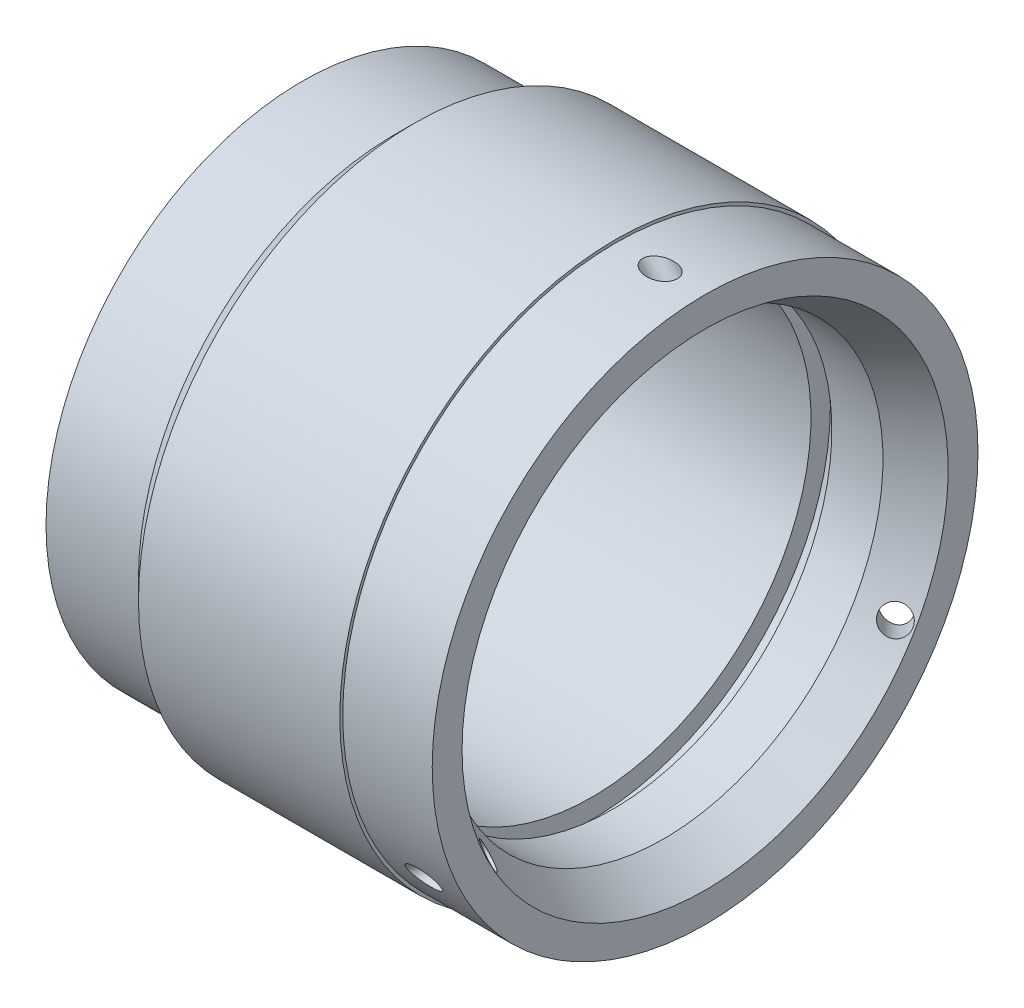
ISO-10303-21;
HEADER;
FILE_DESCRIPTION(('STEP AP214'),'2;1');
FILE_NAME('part.step','',(''),(''),'','','');
FILE_SCHEMA(('AUTOMOTIVE_DESIGN { 1 0 10303 214 1 1 1 1 }'));
ENDSEC;
DATA;
#1=APPLICATION_CONTEXT('core data for automotive mechanical design processes');
#2=APPLICATION_PROTOCOL_DEFINITION('international standard','automotive_design',2000,#1);
#3=PRODUCT_CONTEXT('',#1,'mechanical');
#4=PRODUCT('Part','Part','',(#3));
#5=PRODUCT_RELATED_PRODUCT_CATEGORY('part','',(#4));
#6=PRODUCT_DEFINITION_FORMATION('','',#4);
#7=PRODUCT_DEFINITION_CONTEXT('part definition',#1,'design');
#8=PRODUCT_DEFINITION('design','',#6,#7);
#9=PRODUCT_DEFINITION_SHAPE('','',#8);
#10=(LENGTH_UNIT() NAMED_UNIT(*) SI_UNIT(.MILLI.,.METRE.));
#11=(NAMED_UNIT(*) PLANE_ANGLE_UNIT() SI_UNIT($,.RADIAN.));
#12=(NAMED_UNIT(*) SI_UNIT($,.STERADIAN.) SOLID_ANGLE_UNIT());
#13=UNCERTAINTY_MEASURE_WITH_UNIT(LENGTH_MEASURE(1.E-05),#10,'distance_accuracy_value','');
#14=(GEOMETRIC_REPRESENTATION_CONTEXT(3) GLOBAL_UNCERTAINTY_ASSIGNED_CONTEXT((#13)) GLOBAL_UNIT_ASSIGNED_CONTEXT((#10,
#11,#12)) REPRESENTATION_CONTEXT('',''));
#15=CARTESIAN_POINT('',(0.,0.,0.));
#16=DIRECTION('',(0.,0.,1.));
#17=DIRECTION('',(1.,0.,0.));
#18=AXIS2_PLACEMENT_3D('',#15,#16,#17);
#19=CARTESIAN_POINT('',(0.,0.,0.));
#20=DIRECTION('',(-1.,0.,0.));
#21=DIRECTION('',(0.,0.,1.));
#22=AXIS2_PLACEMENT_3D('',#19,#20,#21);
#23=CYLINDRICAL_SURFACE('',#22,8.6);
#24=CARTESIAN_POINT('',(0.,0.,0.));
#25=DIRECTION('',(-1.,0.,0.));
#26=DIRECTION('',(0.,0.,1.));
#27=AXIS2_PLACEMENT_3D('',#24,#25,#26);
#28=CIRCLE('',#27,8.6);
#29=CARTESIAN_POINT('',(0.,0.,8.6));
#30=VERTEX_POINT('',#29);
#31=EDGE_CURVE('E86',#30,#30,#28,.T.);
#32=ORIENTED_EDGE('',*,*,#31,.F.);
#33=EDGE_LOOP('',(#32));
#34=FACE_BOUND('',#33,.T.);
#35=CARTESIAN_POINT('',(3.1,0.,0.));
#36=DIRECTION('',(-1.,0.,0.));
#37=DIRECTION('',(0.,0.,1.));
#38=AXIS2_PLACEMENT_3D('',#35,#36,#37);
#39=CIRCLE('',#38,8.6);
#40=CARTESIAN_POINT('',(3.1,0.,8.6));
#41=VERTEX_POINT('',#40);
#42=EDGE_CURVE('E10',#41,#41,#39,.T.);
#43=ORIENTED_EDGE('',*,*,#42,.T.);
#44=EDGE_LOOP('',(#43));
#45=FACE_BOUND('',#44,.T.);
#46=ADVANCED_FACE('F34',(#34,#45),#23,.T.);
#47=CARTESIAN_POINT('',(3.75,0.,0.));
#48=DIRECTION('',(1.,0.,0.));
#49=DIRECTION('',(0.,0.,-1.));
#50=AXIS2_PLACEMENT_3D('',#47,#48,#49);
#51=CONICAL_SURFACE('',#50,9.25,0.785398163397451);
#52=ORIENTED_EDGE('',*,*,#42,.F.);
#53=EDGE_LOOP('',(#52));
#54=FACE_BOUND('',#53,.T.);
#55=CARTESIAN_POINT('',(3.75,0.,0.));
#56=DIRECTION('',(-1.,0.,0.));
#57=DIRECTION('',(0.,0.,1.));
#58=AXIS2_PLACEMENT_3D('',#55,#56,#57);
#59=CIRCLE('',#58,9.25);
#60=CARTESIAN_POINT('',(3.75,0.,9.25));
#61=VERTEX_POINT('',#60);
#62=EDGE_CURVE('E45',#61,#61,#59,.T.);
#63=ORIENTED_EDGE('',*,*,#62,.T.);
#64=EDGE_LOOP('',(#63));
#65=FACE_BOUND('',#64,.T.);
#66=ADVANCED_FACE('F117',(#54,#65),#51,.T.);
#67=CARTESIAN_POINT('',(0.,0.,0.));
#68=DIRECTION('',(-1.,0.,0.));
#69=DIRECTION('',(0.,0.,1.));
#70=AXIS2_PLACEMENT_3D('',#67,#68,#69);
#71=CYLINDRICAL_SURFACE('',#70,9.25);
#72=ORIENTED_EDGE('',*,*,#62,.F.);
#73=EDGE_LOOP('',(#72));
#74=FACE_BOUND('',#73,.T.);
#75=CARTESIAN_POINT('',(10.5,0.,0.));
#76=DIRECTION('',(-1.,0.,0.));
#77=DIRECTION('',(0.,0.,1.));
#78=AXIS2_PLACEMENT_3D('',#75,#76,#77);
#79=CIRCLE('',#78,9.25);
#80=CARTESIAN_POINT('',(10.5,0.,9.25));
#81=VERTEX_POINT('',#80);
#82=EDGE_CURVE('E50',#81,#81,#79,.T.);
#83=ORIENTED_EDGE('',*,*,#82,.T.);
#84=EDGE_LOOP('',(#83));
#85=FACE_BOUND('',#84,.T.);
#86=ADVANCED_FACE('F122',(#74,#85),#71,.T.);
#87=CARTESIAN_POINT('',(10.5,9.25,0.));
#88=DIRECTION('',(-1.,0.,0.));
#89=DIRECTION('',(0.,0.,1.));
#90=AXIS2_PLACEMENT_3D('',#87,#88,#89);
#91=PLANE('',#90);
#92=ORIENTED_EDGE('',*,*,#82,.F.);
#93=EDGE_LOOP('',(#92));
#94=FACE_BOUND('',#93,.T.);
#95=CARTESIAN_POINT('',(10.5,0.,0.));
#96=DIRECTION('',(-1.,0.,0.));
#97=DIRECTION('',(0.,0.,1.));
#98=AXIS2_PLACEMENT_3D('',#95,#96,#97);
#99=CIRCLE('',#98,9.15);
#100=CARTESIAN_POINT('',(10.5,0.,9.15));
#101=VERTEX_POINT('',#100);
#102=EDGE_CURVE('E159',#101,#101,#99,.T.);
#103=ORIENTED_EDGE('',*,*,#102,.T.);
#104=EDGE_LOOP('',(#103));
#105=FACE_BOUND('',#104,.T.);
#106=ADVANCED_FACE('F96',(#94,#105),#91,.F.);
#107=CARTESIAN_POINT('',(0.,0.,0.));
#108=DIRECTION('',(-1.,0.,0.));
#109=DIRECTION('',(0.,0.,1.));
#110=AXIS2_PLACEMENT_3D('',#107,#108,#109);
#111=CYLINDRICAL_SURFACE('',#110,9.15);
#112=CARTESIAN_POINT('',(11.4400133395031,-4.70992132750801,7.84468871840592));
#113=CARTESIAN_POINT('',(11.4313150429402,-4.69496688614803,7.85366724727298));
#114=CARTESIAN_POINT('',(11.4239321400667,-4.67940840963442,7.86295004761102));
#115=CARTESIAN_POINT('',(11.4122312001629,-4.64739273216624,7.8819151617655));
#116=CARTESIAN_POINT('',(11.4079139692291,-4.63093529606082,7.89159757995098));
#117=CARTESIAN_POINT('',(11.402631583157,-4.59750646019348,7.91111936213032));
#118=CARTESIAN_POINT('',(11.4016762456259,-4.58053370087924,7.92095910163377));
#119=CARTESIAN_POINT('',(11.4032176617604,-4.54664643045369,7.94045895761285));
#120=CARTESIAN_POINT('',(11.4057140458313,-4.52973191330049,7.9501190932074));
#121=CARTESIAN_POINT('',(11.4138307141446,-4.49704775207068,7.96865125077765));
#122=CARTESIAN_POINT('',(11.4193390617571,-4.48125875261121,7.97753900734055));
#123=CARTESIAN_POINT('',(11.43307048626,-4.45056269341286,7.9947045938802));
#124=CARTESIAN_POINT('',(11.4412943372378,-4.43565588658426,8.00298224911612));
#125=CARTESIAN_POINT('',(11.4609047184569,-4.40567215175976,8.0195306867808));
#126=CARTESIAN_POINT('',(11.4725098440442,-4.39070150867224,8.02773329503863));
#127=CARTESIAN_POINT('',(11.4979536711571,-4.36226841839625,8.04321930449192));
#128=CARTESIAN_POINT('',(11.5117938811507,-4.34880700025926,8.05050207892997));
#129=CARTESIAN_POINT('',(11.5490625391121,-4.31674363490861,8.06775748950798));
#130=CARTESIAN_POINT('',(11.5736875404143,-4.2991940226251,8.0771124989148));
#131=CARTESIAN_POINT('',(11.6258262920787,-4.26777664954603,8.09375678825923));
#132=CARTESIAN_POINT('',(11.6533465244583,-4.25391740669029,8.10104129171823));
#133=CARTESIAN_POINT('',(11.7180605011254,-4.22652692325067,8.11537257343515));
#134=CARTESIAN_POINT('',(11.7558552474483,-4.21410151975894,8.12182042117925));
#135=CARTESIAN_POINT('',(11.8332013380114,-4.19488013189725,8.13176464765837));
#136=CARTESIAN_POINT('',(11.8727536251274,-4.1880872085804,8.13525942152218));
#137=CARTESIAN_POINT('',(11.9529716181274,-4.18002271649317,8.13940605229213));
#138=CARTESIAN_POINT('',(11.9936445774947,-4.17880838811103,8.14002843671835));
#139=CARTESIAN_POINT('',(12.0746930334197,-4.18214427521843,8.13831516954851));
#140=CARTESIAN_POINT('',(12.1150686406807,-4.18669222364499,8.13598068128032));
#141=CARTESIAN_POINT('',(12.1894827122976,-4.20082751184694,8.12869005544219));
#142=CARTESIAN_POINT('',(12.2236875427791,-4.20972235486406,8.12409369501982));
#143=CARTESIAN_POINT('',(12.2900313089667,-4.23229608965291,8.11235679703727));
#144=CARTESIAN_POINT('',(12.3221725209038,-4.24596959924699,8.10521912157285));
#145=CARTESIAN_POINT('',(12.3765269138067,-4.2747597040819,8.09006379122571));
#146=CARTESIAN_POINT('',(12.3993864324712,-4.28892936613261,8.08256775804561));
#147=CARTESIAN_POINT('',(12.4422247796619,-4.32029319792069,8.06584661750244));
#148=CARTESIAN_POINT('',(12.4622071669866,-4.33748357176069,8.05662367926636));
#149=CARTESIAN_POINT('',(12.495146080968,-4.37144668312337,8.03823723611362));
#150=CARTESIAN_POINT('',(12.5087201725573,-4.38776606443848,8.02934577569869));
#151=CARTESIAN_POINT('',(12.5326209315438,-4.42209402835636,8.01049104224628));
#152=CARTESIAN_POINT('',(12.5429489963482,-4.44010187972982,8.0005282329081));
#153=CARTESIAN_POINT('',(12.5598144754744,-4.47750074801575,7.97965835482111));
#154=CARTESIAN_POINT('',(12.5663273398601,-4.4968998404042,7.96874567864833));
#155=CARTESIAN_POINT('',(12.5749942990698,-4.53633897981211,7.94636024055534));
#156=CARTESIAN_POINT('',(12.5771509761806,-4.55637863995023,7.9348878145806));
#157=CARTESIAN_POINT('',(12.5769610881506,-4.5941334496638,7.91308160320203));
#158=CARTESIAN_POINT('',(12.5750856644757,-4.61186083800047,7.90276203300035));
#159=CARTESIAN_POINT('',(12.5678836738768,-4.6467122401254,7.88232030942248));
#160=CARTESIAN_POINT('',(12.5625573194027,-4.66383629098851,7.87219814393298));
#161=CARTESIAN_POINT('',(12.5488095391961,-4.69691349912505,7.85250736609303));
#162=CARTESIAN_POINT('',(12.540412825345,-4.71287481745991,7.8429350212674));
#163=CARTESIAN_POINT('',(12.5209229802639,-4.74347621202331,7.82446505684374));
#164=CARTESIAN_POINT('',(12.5098292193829,-4.75811597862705,7.81556759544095));
#165=CARTESIAN_POINT('',(12.483998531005,-4.78745984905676,7.79763148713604));
#166=CARTESIAN_POINT('',(12.4689918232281,-4.80198497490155,7.78869010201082));
#167=CARTESIAN_POINT('',(12.436744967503,-4.82906471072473,7.77192948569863));
#168=CARTESIAN_POINT('',(12.4195029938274,-4.84161769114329,7.76411118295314));
#169=CARTESIAN_POINT('',(12.3748741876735,-4.87009736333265,7.74629281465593));
#170=CARTESIAN_POINT('',(12.3464908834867,-4.8848888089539,7.73696245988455));
#171=CARTESIAN_POINT('',(12.2872595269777,-4.91033339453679,7.72083887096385));
#172=CARTESIAN_POINT('',(12.2564078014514,-4.92098022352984,7.71404950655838));
#173=CARTESIAN_POINT('',(12.192765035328,-4.93844455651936,7.70288089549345));
#174=CARTESIAN_POINT('',(12.1599531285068,-4.94520726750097,7.69853615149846));
#175=CARTESIAN_POINT('',(12.0935530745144,-4.95485897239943,7.69232764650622));
#176=CARTESIAN_POINT('',(12.0599649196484,-4.95774792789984,7.6904639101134));
#177=CARTESIAN_POINT('',(11.9856978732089,-4.95998706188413,7.68902026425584));
#178=CARTESIAN_POINT('',(11.9449802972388,-4.95848800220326,7.68998839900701));
#179=CARTESIAN_POINT('',(11.8643099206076,-4.95009680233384,7.69539255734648));
#180=CARTESIAN_POINT('',(11.8243575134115,-4.94320195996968,7.69983031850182));
#181=CARTESIAN_POINT('',(11.7510788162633,-4.92506320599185,7.71144298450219));
#182=CARTESIAN_POINT('',(11.7175351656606,-4.91444540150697,7.71822240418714));
#183=CARTESIAN_POINT('',(11.6528941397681,-4.88874452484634,7.73452710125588));
#184=CARTESIAN_POINT('',(11.6217941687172,-4.87366627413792,7.74404941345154));
#185=CARTESIAN_POINT('',(11.5710098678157,-4.84336570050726,7.76302378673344));
#186=CARTESIAN_POINT('',(11.5504599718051,-4.82920036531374,7.7718502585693));
#187=CARTESIAN_POINT('',(11.5122407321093,-4.79827170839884,7.79098307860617));
#188=CARTESIAN_POINT('',(11.4945627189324,-4.7815165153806,7.80128478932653));
#189=CARTESIAN_POINT('',(11.4714313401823,-4.7551149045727,7.81738313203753));
#190=CARTESIAN_POINT('',(11.4644833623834,-4.74643784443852,7.82265535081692));
#191=CARTESIAN_POINT('',(11.4515196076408,-4.72856140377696,7.83347409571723));
#192=CARTESIAN_POINT('',(11.4455043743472,-4.71936172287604,7.83902077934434));
#193=CARTESIAN_POINT('',(11.4400133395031,-4.70992132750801,7.84468871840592));
#194=B_SPLINE_CURVE_WITH_KNOTS('',3,(#112,#113,#114,#115,#116,#117,#118,#119,#120,#121,#122,
#123,#124,#125,#126,#127,#128,#129,#130,#131,#132,#133,#134,#135,#136,#137,#138,#139,#140,#141,
#142,#143,#144,#145,#146,#147,#148,#149,#150,#151,#152,#153,#154,#155,#156,#157,#158,#159,#160,
#161,#162,#163,#164,#165,#166,#167,#168,#169,#170,#171,#172,#173,#174,#175,#176,#177,#178,#179,
#180,#181,#182,#183,#184,#185,#186,#187,#188,#189,#190,#191,#192,#193),.UNSPECIFIED.,.T.,.F.,(4,
2,2,2,2,2,2,2,2,2,2,2,2,2,2,2,2,2,2,2,2,2,2,2,2,2,2,2,2,2,2,2,2,2,2,2,2,2,2,2,4),(0.,
0.0584346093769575,0.1168845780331,0.175505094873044,0.234119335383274,0.290690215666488,
0.347277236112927,0.408976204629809,0.470716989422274,0.56514995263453,0.659799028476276,
0.780087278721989,0.900440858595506,1.02202663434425,1.14356458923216,1.25007751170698,
1.3564708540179,1.43992270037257,1.523270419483,1.59203247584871,1.66076488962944,
1.72993485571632,1.79906380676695,1.86055629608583,1.9220450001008,1.9830493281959,
2.04406791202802,2.1119686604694,2.17992522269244,2.27939754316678,2.37902074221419,
2.48001682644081,2.58101391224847,2.7027662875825,2.82457967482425,2.93167546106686,
3.03865590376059,3.11781822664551,3.19673694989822,3.23360396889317,3.27049239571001),.UNSPECIFIED.);
#195=CARTESIAN_POINT('',(11.4400133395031,-4.70992132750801,7.84468871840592));
#196=VERTEX_POINT('',#195);
#197=EDGE_CURVE('E101',#196,#196,#194,.T.);
#198=ORIENTED_EDGE('',*,*,#197,.T.);
#199=EDGE_LOOP('',(#198));
#200=FACE_BOUND('',#199,.T.);
#201=CARTESIAN_POINT('',(12.5414761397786,-4.43873905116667,-8.00125587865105));
#202=CARTESIAN_POINT('',(12.5305125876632,-4.41834414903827,-8.01257003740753));
#203=CARTESIAN_POINT('',(12.5172482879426,-4.39884865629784,-8.0232826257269));
#204=CARTESIAN_POINT('',(12.4869949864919,-4.3621615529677,-8.04328826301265));
#205=CARTESIAN_POINT('',(12.4700010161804,-4.34497306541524,-8.05257939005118));
#206=CARTESIAN_POINT('',(12.4333009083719,-4.31328319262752,-8.06959783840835));
#207=CARTESIAN_POINT('',(12.4136186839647,-4.29876050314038,-8.0773376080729));
#208=CARTESIAN_POINT('',(12.3721462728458,-4.27228800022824,-8.09137067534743));
#209=CARTESIAN_POINT('',(12.3503557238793,-4.26033863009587,-8.09766372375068));
#210=CARTESIAN_POINT('',(12.2952170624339,-4.23424297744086,-8.11134963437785));
#211=CARTESIAN_POINT('',(12.2610281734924,-4.22147159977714,-8.11799306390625));
#212=CARTESIAN_POINT('',(12.1907611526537,-4.20102787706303,-8.12859127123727));
#213=CARTESIAN_POINT('',(12.1546803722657,-4.19336289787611,-8.13254216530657));
#214=CARTESIAN_POINT('',(12.0812290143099,-4.18287755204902,-8.13794018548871));
#215=CARTESIAN_POINT('',(12.0438484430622,-4.18011318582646,-8.13935837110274));
#216=CARTESIAN_POINT('',(11.9690256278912,-4.17945748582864,-8.13969498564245));
#217=CARTESIAN_POINT('',(11.9315833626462,-4.18156855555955,-8.13861218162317));
#218=CARTESIAN_POINT('',(11.8521388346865,-4.19126955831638,-8.13362131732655));
#219=CARTESIAN_POINT('',(11.8102476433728,-4.19959780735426,-8.12933241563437));
#220=CARTESIAN_POINT('',(11.7287643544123,-4.22268164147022,-8.11736598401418));
#221=CARTESIAN_POINT('',(11.68916981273,-4.23743024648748,-8.10969213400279));
#222=CARTESIAN_POINT('',(11.6258415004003,-4.2679264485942,-8.09367020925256));
#223=CARTESIAN_POINT('',(11.601017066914,-4.28192251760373,-8.08628172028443));
#224=CARTESIAN_POINT('',(11.5541591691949,-4.31313197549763,-8.06967811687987));
#225=CARTESIAN_POINT('',(11.5321208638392,-4.33033965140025,-8.06046624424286));
#226=CARTESIAN_POINT('',(11.4962271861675,-4.36391637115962,-8.04232648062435));
#227=CARTESIAN_POINT('',(11.4816289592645,-4.37968198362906,-8.03375680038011));
#228=CARTESIAN_POINT('',(11.4555235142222,-4.41303821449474,-8.01548216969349));
#229=CARTESIAN_POINT('',(11.4440151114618,-4.43062812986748,-8.00577765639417));
#230=CARTESIAN_POINT('',(11.4247443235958,-4.46746953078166,-7.98527790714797));
#231=CARTESIAN_POINT('',(11.4170184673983,-4.48673518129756,-7.97447320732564));
#232=CARTESIAN_POINT('',(11.4061614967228,-4.5261402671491,-7.95217352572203));
#233=CARTESIAN_POINT('',(11.4030248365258,-4.54627861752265,-7.94067939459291));
#234=CARTESIAN_POINT('',(11.4017484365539,-4.58350183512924,-7.91924244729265));
#235=CARTESIAN_POINT('',(11.4029193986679,-4.60058385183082,-7.90933046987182));
#236=CARTESIAN_POINT('',(11.4086767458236,-4.63424523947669,-7.88965467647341));
#237=CARTESIAN_POINT('',(11.4132629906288,-4.65082463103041,-7.87989085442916));
#238=CARTESIAN_POINT('',(11.4253486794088,-4.68254607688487,-7.86108089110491));
#239=CARTESIAN_POINT('',(11.4327550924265,-4.69771653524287,-7.85202194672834));
#240=CARTESIAN_POINT('',(11.4500799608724,-4.72690498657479,-7.83448528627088));
#241=CARTESIAN_POINT('',(11.4599994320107,-4.74092251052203,-7.82600780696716));
#242=CARTESIAN_POINT('',(11.4864171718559,-4.77311898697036,-7.80642819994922));
#243=CARTESIAN_POINT('',(11.5039479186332,-4.79066029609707,-7.79566764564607));
#244=CARTESIAN_POINT('',(11.5421173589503,-4.8230347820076,-7.77567998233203));
#245=CARTESIAN_POINT('',(11.5627626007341,-4.83786210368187,-7.76645619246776));
#246=CARTESIAN_POINT('',(11.6131466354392,-4.86906291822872,-7.74694551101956));
#247=CARTESIAN_POINT('',(11.6437076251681,-4.88446473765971,-7.73723134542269));
#248=CARTESIAN_POINT('',(11.7073378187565,-4.91085433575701,-7.72050860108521));
#249=CARTESIAN_POINT('',(11.7404087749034,-4.92183899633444,-7.71350193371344));
#250=CARTESIAN_POINT('',(11.808733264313,-4.93976287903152,-7.7020359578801));
#251=CARTESIAN_POINT('',(11.8440163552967,-4.94662114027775,-7.69762766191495));
#252=CARTESIAN_POINT('',(11.9153820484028,-4.95606877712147,-7.69154815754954));
#253=CARTESIAN_POINT('',(11.9514649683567,-4.95865642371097,-7.68987805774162));
#254=CARTESIAN_POINT('',(12.0300503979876,-4.9596322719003,-7.68924903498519));
#255=CARTESIAN_POINT('',(12.0725709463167,-4.95720603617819,-7.69081590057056));
#256=CARTESIAN_POINT('',(12.1565029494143,-4.94623213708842,-7.69787840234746));
#257=CARTESIAN_POINT('',(12.1979149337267,-4.93768745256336,-7.70337212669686));
#258=CARTESIAN_POINT('',(12.2684662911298,-4.91694617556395,-7.71662168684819));
#259=CARTESIAN_POINT('',(12.2981694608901,-4.90611443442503,-7.72352056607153));
#260=CARTESIAN_POINT('',(12.3551299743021,-4.88052013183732,-7.73971919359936));
#261=CARTESIAN_POINT('',(12.3823908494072,-4.86576337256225,-7.7490153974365));
#262=CARTESIAN_POINT('',(12.4281511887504,-4.83560961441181,-7.76785860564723));
#263=CARTESIAN_POINT('',(12.4473082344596,-4.82094369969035,-7.77697585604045));
#264=CARTESIAN_POINT('',(12.4825634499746,-4.78908961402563,-7.79663193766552));
#265=CARTESIAN_POINT('',(12.4986648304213,-4.77190412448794,-7.80716925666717));
#266=CARTESIAN_POINT('',(12.5247886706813,-4.73805330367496,-7.82775065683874));
#267=CARTESIAN_POINT('',(12.5353645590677,-4.7217118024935,-7.83762289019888));
#268=CARTESIAN_POINT('',(12.5531926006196,-4.68767415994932,-7.85802796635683));
#269=CARTESIAN_POINT('',(12.5604463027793,-4.66997865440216,-7.86856049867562));
#270=CARTESIAN_POINT('',(12.5712230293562,-4.63359820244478,-7.89003898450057));
#271=CARTESIAN_POINT('',(12.5747293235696,-4.6149092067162,-7.90098656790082));
#272=CARTESIAN_POINT('',(12.5777131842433,-4.57721466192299,-7.92288333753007));
#273=CARTESIAN_POINT('',(12.5771919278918,-4.55820920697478,-7.93383252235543));
#274=CARTESIAN_POINT('',(12.5723619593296,-4.52202155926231,-7.95450949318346));
#275=CARTESIAN_POINT('',(12.5683558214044,-4.5048139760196,-7.96426542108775));
#276=CARTESIAN_POINT('',(12.5571934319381,-4.47113434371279,-7.9832218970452));
#277=CARTESIAN_POINT('',(12.5500360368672,-4.45466256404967,-7.9924222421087));
#278=CARTESIAN_POINT('',(12.5414761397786,-4.43873905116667,-8.00125587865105));
#279=B_SPLINE_CURVE_WITH_KNOTS('',3,(#201,#202,#203,#204,#205,#206,#207,#208,#209,#210,#211,
#212,#213,#214,#215,#216,#217,#218,#219,#220,#221,#222,#223,#224,#225,#226,#227,#228,#229,#230,
#231,#232,#233,#234,#235,#236,#237,#238,#239,#240,#241,#242,#243,#244,#245,#246,#247,#248,#249,
#250,#251,#252,#253,#254,#255,#256,#257,#258,#259,#260,#261,#262,#263,#264,#265,#266,#267,#268,
#269,#270,#271,#272,#273,#274,#275,#276,#277,#278),.UNSPECIFIED.,.T.,.F.,(4,2,2,2,2,2,2,2,2,2,2,
2,2,2,2,2,2,2,2,2,2,2,2,2,2,2,2,2,2,2,2,2,2,2,2,2,2,2,4),(0.,0.0772217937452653,
0.154547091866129,0.231224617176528,0.307915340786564,0.418608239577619,0.529460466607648,
0.641571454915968,0.753737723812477,0.881897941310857,1.00991917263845,1.09794567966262,
1.18581706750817,1.25495338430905,1.32406315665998,1.39382778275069,1.46350803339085,
1.52255834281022,1.58160622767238,1.63885477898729,1.69612650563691,1.77678156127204,
1.85760862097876,1.96376594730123,2.06999807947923,2.17825176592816,2.28654926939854,
2.41380494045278,2.54099869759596,2.63772800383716,2.73431510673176,2.81139716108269,
2.88839777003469,2.95359911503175,3.01877002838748,3.08423069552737,3.14967223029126,
3.20994198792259,3.27023363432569),.UNSPECIFIED.);
#280=CARTESIAN_POINT('',(12.5414761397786,-4.43873905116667,-8.00125587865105));
#281=VERTEX_POINT('',#280);
#282=EDGE_CURVE('E60',#281,#281,#279,.T.);
#283=ORIENTED_EDGE('',*,*,#282,.T.);
#284=EDGE_LOOP('',(#283));
#285=FACE_BOUND('',#284,.T.);
#286=CARTESIAN_POINT('',(12.5770539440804,9.15,0.));
#287=CARTESIAN_POINT('',(12.5770505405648,9.14999978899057,0.0213884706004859));
#288=CARTESIAN_POINT('',(12.5751103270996,9.14992396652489,0.042814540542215));
#289=CARTESIAN_POINT('',(12.567461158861,9.14962956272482,0.0850160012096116));
#290=CARTESIAN_POINT('',(12.5617416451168,9.14941058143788,0.105789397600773));
#291=CARTESIAN_POINT('',(12.5469201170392,9.14885770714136,0.145959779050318));
#292=CARTESIAN_POINT('',(12.537835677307,9.14852441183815,0.165363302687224));
#293=CARTESIAN_POINT('',(12.5167587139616,9.14777805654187,0.202489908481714));
#294=CARTESIAN_POINT('',(12.5047672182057,9.14736502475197,0.220213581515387));
#295=CARTESIAN_POINT('',(12.4774463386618,9.14646560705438,0.254930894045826));
#296=CARTESIAN_POINT('',(12.4619415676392,9.14597610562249,0.271785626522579));
#297=CARTESIAN_POINT('',(12.4287444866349,9.14498935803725,0.303177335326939));
#298=CARTESIAN_POINT('',(12.4110504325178,9.14449210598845,0.317712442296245));
#299=CARTESIAN_POINT('',(12.3651863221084,9.14329569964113,0.350762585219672));
#300=CARTESIAN_POINT('',(12.3360218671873,9.14261238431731,0.367904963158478));
#301=CARTESIAN_POINT('',(12.2752918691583,9.141385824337,0.397215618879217));
#302=CARTESIAN_POINT('',(12.2437226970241,9.14084279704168,0.409376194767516));
#303=CARTESIAN_POINT('',(12.1787139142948,9.13994028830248,0.429056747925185));
#304=CARTESIAN_POINT('',(12.1452547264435,9.13958339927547,0.436511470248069));
#305=CARTESIAN_POINT('',(12.0776418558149,9.13909021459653,0.446716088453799));
#306=CARTESIAN_POINT('',(12.0434881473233,9.13895392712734,0.449465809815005));
#307=CARTESIAN_POINT('',(11.9683046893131,9.13890393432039,0.450485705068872));
#308=CARTESIAN_POINT('',(11.9272587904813,9.13903990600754,0.447755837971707));
#309=CARTESIAN_POINT('',(11.8461031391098,9.13961946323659,0.435766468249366));
#310=CARTESIAN_POINT('',(11.805993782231,9.14006317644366,0.426504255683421));
#311=CARTESIAN_POINT('',(11.7337341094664,9.14111924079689,0.403178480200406));
#312=CARTESIAN_POINT('',(11.7012869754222,9.14169671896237,0.390033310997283));
#313=CARTESIAN_POINT('',(11.6389171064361,9.14297941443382,0.358711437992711));
#314=CARTESIAN_POINT('',(11.6089906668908,9.14368443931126,0.340542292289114));
#315=CARTESIAN_POINT('',(11.5599552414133,9.14495651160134,0.304159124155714));
#316=CARTESIAN_POINT('',(11.540006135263,9.145514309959,0.28707822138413));
#317=CARTESIAN_POINT('',(11.5030672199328,9.146603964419,0.24995905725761));
#318=CARTESIAN_POINT('',(11.4860734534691,9.14713585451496,0.229924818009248));
#319=CARTESIAN_POINT('',(11.4588682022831,9.14801952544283,0.191152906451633));
#320=CARTESIAN_POINT('',(11.4479816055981,9.14838632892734,0.17289122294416));
#321=CARTESIAN_POINT('',(11.4293630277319,9.14902655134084,0.134813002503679));
#322=CARTESIAN_POINT('',(11.4216291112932,9.14930002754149,0.114997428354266));
#323=CARTESIAN_POINT('',(11.4098052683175,9.14972243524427,0.0741504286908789));
#324=CARTESIAN_POINT('',(11.4057392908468,9.14987054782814,0.0531119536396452));
#325=CARTESIAN_POINT('',(11.4016804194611,9.15001838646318,0.0106453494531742));
#326=CARTESIAN_POINT('',(11.4016856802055,9.15001817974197,-0.0107825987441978));
#327=CARTESIAN_POINT('',(11.4055406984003,9.1498777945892,-0.0509601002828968));
#328=CARTESIAN_POINT('',(11.4089791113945,9.14975259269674,-0.0697509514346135));
#329=CARTESIAN_POINT('',(11.4188614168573,9.14939846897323,-0.106517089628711));
#330=CARTESIAN_POINT('',(11.4253056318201,9.14916953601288,-0.124492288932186));
#331=CARTESIAN_POINT('',(11.4410950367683,9.14862143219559,-0.159842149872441));
#332=CARTESIAN_POINT('',(11.450531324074,9.14829946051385,-0.177175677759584));
#333=CARTESIAN_POINT('',(11.4717600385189,9.14759746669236,-0.210323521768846));
#334=CARTESIAN_POINT('',(11.4835537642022,9.14721741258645,-0.226136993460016));
#335=CARTESIAN_POINT('',(11.5151629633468,9.14623789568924,-0.263296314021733));
#336=CARTESIAN_POINT('',(11.5361186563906,9.14562036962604,-0.283674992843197));
#337=CARTESIAN_POINT('',(11.5810520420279,9.14439401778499,-0.320786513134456));
#338=CARTESIAN_POINT('',(11.6050365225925,9.1437852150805,-0.337510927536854));
#339=CARTESIAN_POINT('',(11.6626590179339,9.142460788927,-0.371874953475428));
#340=CARTESIAN_POINT('',(11.6970328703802,9.14176799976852,-0.38828081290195));
#341=CARTESIAN_POINT('',(11.7679548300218,9.14058026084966,-0.415299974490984));
#342=CARTESIAN_POINT('',(11.8045039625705,9.14008540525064,-0.425910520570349));
#343=CARTESIAN_POINT('',(11.8793298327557,9.13933936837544,-0.441631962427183));
#344=CARTESIAN_POINT('',(11.9176241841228,9.1390919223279,-0.446658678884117));
#345=CARTESIAN_POINT('',(11.9945575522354,9.13888099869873,-0.450952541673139));
#346=CARTESIAN_POINT('',(12.0331967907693,9.13891771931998,-0.450215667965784));
#347=CARTESIAN_POINT('',(12.1144042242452,9.139299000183,-0.44241767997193));
#348=CARTESIAN_POINT('',(12.1569057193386,9.13967892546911,-0.434629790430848));
#349=CARTESIAN_POINT('',(12.2397426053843,9.14075755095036,-0.411326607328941));
#350=CARTESIAN_POINT('',(12.2800813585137,9.14145573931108,-0.395823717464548));
#351=CARTESIAN_POINT('',(12.3441697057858,9.14280403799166,-0.363049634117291));
#352=CARTESIAN_POINT('',(12.3690549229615,9.1433962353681,-0.347984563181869));
#353=CARTESIAN_POINT('',(12.4160909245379,9.14462397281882,-0.314070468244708));
#354=CARTESIAN_POINT('',(12.4382463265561,9.14525943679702,-0.295227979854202));
#355=CARTESIAN_POINT('',(12.4751588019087,9.14638996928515,-0.257561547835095));
#356=CARTESIAN_POINT('',(12.490530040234,9.14688976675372,-0.239341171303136));
#357=CARTESIAN_POINT('',(12.5180880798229,9.14782145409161,-0.20059217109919));
#358=CARTESIAN_POINT('',(12.5302738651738,9.1482533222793,-0.180062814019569));
#359=CARTESIAN_POINT('',(12.5508435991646,9.14900069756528,-0.136947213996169));
#360=CARTESIAN_POINT('',(12.5591943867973,9.14931518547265,-0.114344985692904));
#361=CARTESIAN_POINT('',(12.571313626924,9.14977648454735,-0.0679846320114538));
#362=CARTESIAN_POINT('',(12.575098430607,9.14992389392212,-0.0442309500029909));
#363=CARTESIAN_POINT('',(12.5768602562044,9.14999248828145,-0.0135990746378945));
#364=CARTESIAN_POINT('',(12.5770550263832,9.15000006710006,-0.00680143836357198));
#365=CARTESIAN_POINT('',(12.5770539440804,9.15,0.));
#366=B_SPLINE_CURVE_WITH_KNOTS('',3,(#286,#287,#288,#289,#290,#291,#292,#293,#294,#295,#296,
#297,#298,#299,#300,#301,#302,#303,#304,#305,#306,#307,#308,#309,#310,#311,#312,#313,#314,#315,
#316,#317,#318,#319,#320,#321,#322,#323,#324,#325,#326,#327,#328,#329,#330,#331,#332,#333,#334,
#335,#336,#337,#338,#339,#340,#341,#342,#343,#344,#345,#346,#347,#348,#349,#350,#351,#352,#353,
#354,#355,#356,#357,#358,#359,#360,#361,#362,#363,#364,#365),.UNSPECIFIED.,.T.,.F.,(4,2,2,2,2,2,
2,2,2,2,2,2,2,2,2,2,2,2,2,2,2,2,2,2,2,2,2,2,2,2,2,2,2,2,2,2,2,2,2,4),(0.,0.0641454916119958,
0.128470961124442,0.192465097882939,0.256436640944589,0.324905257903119,0.393428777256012,
0.494386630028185,0.595499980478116,0.6979863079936,0.800476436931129,0.923356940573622,
1.04628845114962,1.15094607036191,1.25544709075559,1.33397981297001,1.41240655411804,
1.47594338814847,1.53944116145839,1.60335059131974,1.66723105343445,1.72427758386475,
1.78133023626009,1.84032067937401,1.89934370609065,1.98657063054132,2.07399663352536,
2.18768027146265,2.3014179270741,2.41684790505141,2.5323584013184,2.66132591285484,
2.7900867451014,2.87706632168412,2.9638966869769,3.03514375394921,3.10641351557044,
3.17828844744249,3.24990521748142,3.27030319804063),.UNSPECIFIED.);
#367=CARTESIAN_POINT('',(12.5770539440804,9.15,0.));
#368=VERTEX_POINT('',#367);
#369=EDGE_CURVE('E59',#368,#368,#366,.T.);
#370=ORIENTED_EDGE('',*,*,#369,.T.);
#371=EDGE_LOOP('',(#370));
#372=FACE_BOUND('',#371,.T.);
#373=ORIENTED_EDGE('',*,*,#102,.F.);
#374=EDGE_LOOP('',(#373));
#375=FACE_BOUND('',#374,.T.);
#376=CARTESIAN_POINT('',(13.5,0.,0.));
#377=DIRECTION('',(-1.,0.,0.));
#378=DIRECTION('',(0.,0.,1.));
#379=AXIS2_PLACEMENT_3D('',#376,#377,#378);
#380=CIRCLE('',#379,9.15);
#381=CARTESIAN_POINT('',(13.5,0.,9.15));
#382=VERTEX_POINT('',#381);
#383=EDGE_CURVE('E156',#382,#382,#380,.T.);
#384=ORIENTED_EDGE('',*,*,#383,.T.);
#385=EDGE_LOOP('',(#384));
#386=FACE_BOUND('',#385,.T.);
#387=ADVANCED_FACE('F91',(#200,#285,#372,#375,#386),#111,.T.);
#388=CARTESIAN_POINT('',(13.5,9.15,0.));
#389=DIRECTION('',(-1.,0.,0.));
#390=DIRECTION('',(0.,0.,1.));
#391=AXIS2_PLACEMENT_3D('',#388,#389,#390);
#392=PLANE('',#391);
#393=ORIENTED_EDGE('',*,*,#383,.F.);
#394=EDGE_LOOP('',(#393));
#395=FACE_BOUND('',#394,.T.);
#396=CARTESIAN_POINT('',(13.5,0.,0.));
#397=DIRECTION('',(-1.,0.,0.));
#398=DIRECTION('',(0.,0.,1.));
#399=AXIS2_PLACEMENT_3D('',#396,#397,#398);
#400=CIRCLE('',#399,8.15);
#401=CARTESIAN_POINT('',(13.5,0.,8.15));
#402=VERTEX_POINT('',#401);
#403=EDGE_CURVE('E153',#402,#402,#400,.T.);
#404=ORIENTED_EDGE('',*,*,#403,.T.);
#405=EDGE_LOOP('',(#404));
#406=FACE_BOUND('',#405,.T.);
#407=ADVANCED_FACE('F95',(#395,#406),#392,.F.);
#408=CARTESIAN_POINT('',(12.1143593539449,0.,0.));
#409=DIRECTION('',(1.,0.,0.));
#410=DIRECTION('',(0.,0.,-1.));
#411=AXIS2_PLACEMENT_3D('',#408,#409,#410);
#412=CONICAL_SURFACE('',#411,7.35,0.523598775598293);
#413=CARTESIAN_POINT('',(12.7783657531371,-4.14509745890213,6.52863615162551));
#414=CARTESIAN_POINT('',(12.7951119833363,-4.16491786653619,6.52750455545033));
#415=CARTESIAN_POINT('',(12.8131782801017,-4.18373404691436,6.52784428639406));
#416=CARTESIAN_POINT('',(12.8513788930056,-4.21884560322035,6.53147915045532));
#417=CARTESIAN_POINT('',(12.8715161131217,-4.23513735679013,6.53477848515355));
#418=CARTESIAN_POINT('',(12.9132234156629,-4.2647421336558,6.54425685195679));
#419=CARTESIAN_POINT('',(12.9347921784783,-4.27805785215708,6.55043326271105));
#420=CARTESIAN_POINT('',(12.9787466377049,-4.30136970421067,6.56550858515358));
#421=CARTESIAN_POINT('',(13.0011320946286,-4.31136680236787,6.57440670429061));
#422=CARTESIAN_POINT('',(13.0462153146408,-4.32781271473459,6.5947477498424));
#423=CARTESIAN_POINT('',(13.068914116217,-4.33424182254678,6.60620432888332));
#424=CARTESIAN_POINT('',(13.1138564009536,-4.34326458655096,6.63131515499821));
#425=CARTESIAN_POINT('',(13.136099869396,-4.34585811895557,6.64496947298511));
#426=CARTESIAN_POINT('',(13.1793744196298,-4.34709693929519,6.67399603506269));
#427=CARTESIAN_POINT('',(13.2004115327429,-4.34576401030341,6.68935834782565));
#428=CARTESIAN_POINT('',(13.2408064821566,-4.33919226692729,6.72139972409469));
#429=CARTESIAN_POINT('',(13.2601644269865,-4.33395370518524,6.7380787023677));
#430=CARTESIAN_POINT('',(13.2964286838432,-4.31976396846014,6.77203127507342));
#431=CARTESIAN_POINT('',(13.3133615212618,-4.31085789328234,6.78929538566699));
#432=CARTESIAN_POINT('',(13.3445708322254,-4.2895530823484,6.82406818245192));
#433=CARTESIAN_POINT('',(13.3588474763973,-4.27715457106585,6.84157685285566));
#434=CARTESIAN_POINT('',(13.3841975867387,-4.24934972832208,6.87609150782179));
#435=CARTESIAN_POINT('',(13.3953056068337,-4.23397917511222,6.89310094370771));
#436=CARTESIAN_POINT('',(13.4142270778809,-4.20055672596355,6.92629823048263));
#437=CARTESIAN_POINT('',(13.422040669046,-4.1825049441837,6.94248611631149));
#438=CARTESIAN_POINT('',(13.4341133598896,-4.14436616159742,6.97342926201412));
#439=CARTESIAN_POINT('',(13.4383985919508,-4.12429538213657,6.98819432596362));
#440=CARTESIAN_POINT('',(13.4433965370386,-4.08257098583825,7.01599057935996));
#441=CARTESIAN_POINT('',(13.4441093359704,-4.06091740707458,7.02902181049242));
#442=CARTESIAN_POINT('',(13.4419469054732,-4.01671830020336,7.05293555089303));
#443=CARTESIAN_POINT('',(13.4390835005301,-3.994175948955,7.06382500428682));
#444=CARTESIAN_POINT('',(13.4298658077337,-3.94877842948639,7.08321052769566));
#445=CARTESIAN_POINT('',(13.4235115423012,-3.92592326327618,7.09170661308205));
#446=CARTESIAN_POINT('',(13.407479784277,-3.88054990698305,7.10609184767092));
#447=CARTESIAN_POINT('',(13.3978009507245,-3.85803185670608,7.11197994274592));
#448=CARTESIAN_POINT('',(13.3753816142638,-3.81399256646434,7.12101407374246));
#449=CARTESIAN_POINT('',(13.3626410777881,-3.79247133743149,7.12416007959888));
#450=CARTESIAN_POINT('',(13.3343832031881,-3.75095804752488,7.12767410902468));
#451=CARTESIAN_POINT('',(13.3188545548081,-3.73097270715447,7.12803054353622));
#452=CARTESIAN_POINT('',(13.2854782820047,-3.69320273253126,7.12597614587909));
#453=CARTESIAN_POINT('',(13.2676305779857,-3.67541817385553,7.12356521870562));
#454=CARTESIAN_POINT('',(13.2299428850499,-3.64241227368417,7.11606332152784));
#455=CARTESIAN_POINT('',(13.210087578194,-3.62721345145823,7.11095025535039));
#456=CARTESIAN_POINT('',(13.1690528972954,-3.59998197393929,7.09822121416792));
#457=CARTESIAN_POINT('',(13.1478734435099,-3.58794950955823,7.09060508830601));
#458=CARTESIAN_POINT('',(13.104511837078,-3.56725190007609,7.07301319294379));
#459=CARTESIAN_POINT('',(13.0823208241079,-3.55862800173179,7.06301073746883));
#460=CARTESIAN_POINT('',(13.0377854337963,-3.54517674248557,7.04099594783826));
#461=CARTESIAN_POINT('',(13.0154410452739,-3.54034966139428,7.02898346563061));
#462=CARTESIAN_POINT('',(12.9709658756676,-3.53457863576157,7.00313626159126));
#463=CARTESIAN_POINT('',(12.9488404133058,-3.5336794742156,6.98928237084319));
#464=CARTESIAN_POINT('',(12.9056990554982,-3.53590174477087,6.96023231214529));
#465=CARTESIAN_POINT('',(12.8846832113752,-3.53902336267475,6.94503608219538));
#466=CARTESIAN_POINT('',(12.8443023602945,-3.54921672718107,6.91363614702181));
#467=CARTESIAN_POINT('',(12.8249439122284,-3.55630340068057,6.89742884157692));
#468=CARTESIAN_POINT('',(12.7885653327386,-3.57424130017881,6.86447936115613));
#469=CARTESIAN_POINT('',(12.7715451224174,-3.58509239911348,6.84773720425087));
#470=CARTESIAN_POINT('',(12.7405536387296,-3.61012854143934,6.8143283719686));
#471=CARTESIAN_POINT('',(12.7265534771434,-3.62427902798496,6.79766262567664));
#472=CARTESIAN_POINT('',(12.7018641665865,-3.65557017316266,6.76468827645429));
#473=CARTESIAN_POINT('',(12.691174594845,-3.67271044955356,6.74837962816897));
#474=CARTESIAN_POINT('',(12.6736804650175,-3.70908040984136,6.71692104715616));
#475=CARTESIAN_POINT('',(12.6667973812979,-3.7282572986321,6.70175374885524));
#476=CARTESIAN_POINT('',(12.6568185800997,-3.76842901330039,6.67263175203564));
#477=CARTESIAN_POINT('',(12.6537222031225,-3.78942352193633,6.65867684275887));
#478=CARTESIAN_POINT('',(12.6514530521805,-3.83217608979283,6.63264932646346));
#479=CARTESIAN_POINT('',(12.652203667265,-3.85391074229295,6.62054487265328));
#480=CARTESIAN_POINT('',(12.6574257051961,-3.89790914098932,6.59823827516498));
#481=CARTESIAN_POINT('',(12.6618979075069,-3.92017299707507,6.5880365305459));
#482=CARTESIAN_POINT('',(12.6743822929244,-3.9645213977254,6.56986410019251));
#483=CARTESIAN_POINT('',(12.6823827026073,-3.98660629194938,6.56188613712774));
#484=CARTESIAN_POINT('',(12.7016437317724,-4.0300604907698,6.54834925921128));
#485=CARTESIAN_POINT('',(12.7129006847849,-4.05143057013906,6.5427876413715));
#486=CARTESIAN_POINT('',(12.7333728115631,-4.08486596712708,6.53588879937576));
#487=CARTESIAN_POINT('',(12.7416901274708,-4.09732939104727,6.53374971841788));
#488=CARTESIAN_POINT('',(12.759311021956,-4.12167452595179,6.53045285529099));
#489=CARTESIAN_POINT('',(12.7686145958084,-4.1335562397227,6.52929506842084));
#490=CARTESIAN_POINT('',(12.7783657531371,-4.14509745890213,6.52863615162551));
#491=B_SPLINE_CURVE_WITH_KNOTS('',3,(#413,#414,#415,#416,#417,#418,#419,#420,#421,#422,#423,
#424,#425,#426,#427,#428,#429,#430,#431,#432,#433,#434,#435,#436,#437,#438,#439,#440,#441,#442,
#443,#444,#445,#446,#447,#448,#449,#450,#451,#452,#453,#454,#455,#456,#457,#458,#459,#460,#461,
#462,#463,#464,#465,#466,#467,#468,#469,#470,#471,#472,#473,#474,#475,#476,#477,#478,#479,#480,
#481,#482,#483,#484,#485,#486,#487,#488,#489,#490),.UNSPECIFIED.,.T.,.F.,(4,2,2,2,2,2,2,2,2,2,2,
2,2,2,2,2,2,2,2,2,2,2,2,2,2,2,2,2,2,2,2,2,2,2,2,2,2,2,4),(0.,0.0778611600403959,
0.155833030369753,0.233733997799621,0.311612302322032,0.389916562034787,0.468223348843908,
0.546096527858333,0.623964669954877,0.700902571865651,0.777835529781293,0.85389430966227,
0.929949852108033,1.00543689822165,1.08092212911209,1.15615843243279,1.23139425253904,
1.30666045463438,1.38192748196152,1.45750703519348,1.533089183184,1.60929917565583,
1.68551376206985,1.76262427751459,1.8397404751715,1.91773363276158,1.99573039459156,
2.07402277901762,2.15231252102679,2.2298164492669,2.30731047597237,2.38313975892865,
2.45895583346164,2.53326800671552,2.60759574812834,2.68167731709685,2.75567580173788,
2.801013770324,2.84635152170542),.UNSPECIFIED.);
#492=CARTESIAN_POINT('',(12.7783657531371,-4.14509745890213,6.52863615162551));
#493=VERTEX_POINT('',#492);
#494=EDGE_CURVE('E37',#493,#493,#491,.T.);
#495=ORIENTED_EDGE('',*,*,#494,.T.);
#496=EDGE_LOOP('',(#495));
#497=FACE_BOUND('',#496,.T.);
#498=CARTESIAN_POINT('',(13.3890981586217,-3.84099609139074,-7.11545308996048));
#499=CARTESIAN_POINT('',(13.4000754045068,-3.86308756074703,-7.11072990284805));
#500=CARTESIAN_POINT('',(13.4095181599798,-3.8856680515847,-7.10463625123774));
#501=CARTESIAN_POINT('',(13.4250667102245,-3.93114342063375,-7.08984149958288));
#502=CARTESIAN_POINT('',(13.4311687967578,-3.95403861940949,-7.08113751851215));
#503=CARTESIAN_POINT('',(13.4398595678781,-3.99945832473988,-7.06135080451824));
#504=CARTESIAN_POINT('',(13.4424494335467,-4.02198295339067,-7.05026887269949));
#505=CARTESIAN_POINT('',(13.4440480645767,-4.06601484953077,-7.02603337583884));
#506=CARTESIAN_POINT('',(13.4430576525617,-4.0875223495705,-7.01288028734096));
#507=CARTESIAN_POINT('',(13.437528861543,-4.12888445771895,-6.98490015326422));
#508=CARTESIAN_POINT('',(13.4329958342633,-4.14874150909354,-6.97007566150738));
#509=CARTESIAN_POINT('',(13.4205098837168,-4.18628686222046,-6.939172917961));
#510=CARTESIAN_POINT('',(13.4125568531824,-4.20397509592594,-6.92309462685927));
#511=CARTESIAN_POINT('',(13.3934329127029,-4.23672186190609,-6.89014521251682));
#512=CARTESIAN_POINT('',(13.3822580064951,-4.251777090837,-6.8732731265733));
#513=CARTESIAN_POINT('',(13.3569960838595,-4.27883426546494,-6.83926393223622));
#514=CARTESIAN_POINT('',(13.342909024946,-4.29083616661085,-6.82212681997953));
#515=CARTESIAN_POINT('',(13.3121243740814,-4.31153859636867,-6.7880159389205));
#516=CARTESIAN_POINT('',(13.2954138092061,-4.32022194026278,-6.77104345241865));
#517=CARTESIAN_POINT('',(13.2598894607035,-4.33399778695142,-6.73786053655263));
#518=CARTESIAN_POINT('',(13.2410755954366,-4.33909015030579,-6.72165013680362));
#519=CARTESIAN_POINT('',(13.2016717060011,-4.34561537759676,-6.6903222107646));
#520=CARTESIAN_POINT('',(13.1810668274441,-4.34701386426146,-6.67521621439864));
#521=CARTESIAN_POINT('',(13.138797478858,-4.34605424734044,-6.64670207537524));
#522=CARTESIAN_POINT('',(13.1171329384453,-4.34369589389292,-6.63329404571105));
#523=CARTESIAN_POINT('',(13.0730672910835,-4.33526809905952,-6.60839894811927));
#524=CARTESIAN_POINT('',(13.0506604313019,-4.32915388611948,-6.59693721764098));
#525=CARTESIAN_POINT('',(13.0059878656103,-4.31336503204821,-6.57644875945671));
#526=CARTESIAN_POINT('',(12.9837221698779,-4.30369013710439,-6.56742220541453));
#527=CARTESIAN_POINT('',(12.939728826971,-4.28093123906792,-6.55196040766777));
#528=CARTESIAN_POINT('',(12.9180090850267,-4.26781314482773,-6.54555281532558));
#529=CARTESIAN_POINT('',(12.8759799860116,-4.23856728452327,-6.53562583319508));
#530=CARTESIAN_POINT('',(12.8556706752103,-4.22243941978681,-6.53210653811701));
#531=CARTESIAN_POINT('',(12.8170552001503,-4.18758072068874,-6.52803635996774));
#532=CARTESIAN_POINT('',(12.7987508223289,-4.16884759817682,-6.5274881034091));
#533=CARTESIAN_POINT('',(12.7647442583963,-4.1292841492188,-6.52936872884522));
#534=CARTESIAN_POINT('',(12.7490419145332,-4.10845395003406,-6.53179743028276));
#535=CARTESIAN_POINT('',(12.7209541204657,-4.06555367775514,-6.53949753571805));
#536=CARTESIAN_POINT('',(12.7085269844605,-4.04350399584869,-6.54473035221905));
#537=CARTESIAN_POINT('',(12.687147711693,-3.99852745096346,-6.55785275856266));
#538=CARTESIAN_POINT('',(12.6781950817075,-3.97560071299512,-6.56574197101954));
#539=CARTESIAN_POINT('',(12.6642503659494,-3.93005612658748,-6.58372795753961));
#540=CARTESIAN_POINT('',(12.6591734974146,-3.90744297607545,-6.59377092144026));
#541=CARTESIAN_POINT('',(12.6528361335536,-3.86266749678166,-6.61586353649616));
#542=CARTESIAN_POINT('',(12.6515751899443,-3.84050511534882,-6.6279129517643));
#543=CARTESIAN_POINT('',(12.6529038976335,-3.7976510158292,-6.65344189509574));
#544=CARTESIAN_POINT('',(12.6554286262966,-3.776940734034,-6.66689371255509));
#545=CARTESIAN_POINT('',(12.6641191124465,-3.73717629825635,-6.69501183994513));
#546=CARTESIAN_POINT('',(12.6702848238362,-3.71812212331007,-6.70967813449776));
#547=CARTESIAN_POINT('',(12.6860497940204,-3.68218691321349,-6.73983963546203));
#548=CARTESIAN_POINT('',(12.6956522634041,-3.66530793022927,-6.75533560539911));
#549=CARTESIAN_POINT('',(12.7179694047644,-3.63420132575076,-6.78674037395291));
#550=CARTESIAN_POINT('',(12.7306843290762,-3.61997391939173,-6.80264920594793));
#551=CARTESIAN_POINT('',(12.7590763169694,-3.59431725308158,-6.83476726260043));
#552=CARTESIAN_POINT('',(12.7748020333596,-3.58294224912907,-6.8509767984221));
#553=CARTESIAN_POINT('',(12.8085787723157,-3.5636232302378,-6.88301286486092));
#554=CARTESIAN_POINT('',(12.826630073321,-3.55567962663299,-6.89883934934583));
#555=CARTESIAN_POINT('',(12.864952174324,-3.54329390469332,-6.93006831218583));
#556=CARTESIAN_POINT('',(12.8852632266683,-3.53893309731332,-6.94545367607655));
#557=CARTESIAN_POINT('',(12.9271744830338,-3.53413172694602,-6.9750352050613));
#558=CARTESIAN_POINT('',(12.9487747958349,-3.53369149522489,-6.98923126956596));
#559=CARTESIAN_POINT('',(12.992942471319,-3.53677209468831,-7.01624163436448));
#560=CARTESIAN_POINT('',(13.0155187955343,-3.54034489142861,-7.02903539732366));
#561=CARTESIAN_POINT('',(13.0607226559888,-3.55144887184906,-7.05266454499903));
#562=CARTESIAN_POINT('',(13.0833501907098,-3.55897993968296,-7.06349998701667));
#563=CARTESIAN_POINT('',(13.1279917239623,-3.57779159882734,-7.08287754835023));
#564=CARTESIAN_POINT('',(13.1500063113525,-3.58906844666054,-7.09142194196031));
#565=CARTESIAN_POINT('',(13.1928231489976,-3.61506463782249,-7.10595143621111));
#566=CARTESIAN_POINT('',(13.2136251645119,-3.62978464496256,-7.11193604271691));
#567=CARTESIAN_POINT('',(13.2532151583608,-3.66207613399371,-7.12107457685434));
#568=CARTESIAN_POINT('',(13.2720210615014,-3.67961789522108,-7.12425598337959));
#569=CARTESIAN_POINT('',(13.307304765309,-3.7171301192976,-7.12773822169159));
#570=CARTESIAN_POINT('',(13.3237854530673,-3.73709751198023,-7.1280426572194));
#571=CARTESIAN_POINT('',(13.3484202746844,-3.77118516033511,-7.12614750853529));
#572=CARTESIAN_POINT('',(13.3574111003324,-3.78476336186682,-7.12482552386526));
#573=CARTESIAN_POINT('',(13.374183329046,-3.81249090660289,-7.12101295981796));
#574=CARTESIAN_POINT('',(13.3819647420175,-3.82664024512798,-7.11852239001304));
#575=CARTESIAN_POINT('',(13.3890981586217,-3.84099609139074,-7.11545308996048));
#576=B_SPLINE_CURVE_WITH_KNOTS('',3,(#498,#499,#500,#501,#502,#503,#504,#505,#506,#507,#508,
#509,#510,#511,#512,#513,#514,#515,#516,#517,#518,#519,#520,#521,#522,#523,#524,#525,#526,#527,
#528,#529,#530,#531,#532,#533,#534,#535,#536,#537,#538,#539,#540,#541,#542,#543,#544,#545,#546,
#547,#548,#549,#550,#551,#552,#553,#554,#555,#556,#557,#558,#559,#560,#561,#562,#563,#564,#565,
#566,#567,#568,#569,#570,#571,#572,#573,#574,#575),.UNSPECIFIED.,.T.,.F.,(4,2,2,2,2,2,2,2,2,2,2,
2,2,2,2,2,2,2,2,2,2,2,2,2,2,2,2,2,2,2,2,2,2,2,2,2,2,2,4),(0.,0.0752904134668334,
0.150664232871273,0.226012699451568,0.301343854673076,0.376561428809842,0.451781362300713,
0.527094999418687,0.602409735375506,0.678109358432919,0.753811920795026,0.83021657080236,
0.906626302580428,0.983965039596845,1.06130929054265,1.13945027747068,1.21759382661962,
1.29580644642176,1.3740143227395,1.45117262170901,1.52831996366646,1.60372709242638,
1.67912536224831,1.75324528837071,1.82736427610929,1.90155268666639,1.9757471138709,
2.05126088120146,2.12678369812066,2.20397651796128,2.28117586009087,2.35938651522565,
2.4375948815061,2.51572532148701,2.59387083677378,2.67124150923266,2.74851525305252,
2.79744212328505,2.84636859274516),.UNSPECIFIED.);
#577=CARTESIAN_POINT('',(13.3890981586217,-3.84099609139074,-7.11545308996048));
#578=VERTEX_POINT('',#577);
#579=EDGE_CURVE('E61',#578,#578,#576,.T.);
#580=ORIENTED_EDGE('',*,*,#579,.T.);
#581=EDGE_LOOP('',(#580));
#582=FACE_BOUND('',#581,.T.);
#583=CARTESIAN_POINT('',(12.6871617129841,7.67854727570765,-0.18215600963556));
#584=CARTESIAN_POINT('',(12.6780855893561,7.67384034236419,-0.159612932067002));
#585=CARTESIAN_POINT('',(12.6706682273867,7.67001308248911,-0.136201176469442));
#586=CARTESIAN_POINT('',(12.6594181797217,7.66421864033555,-0.0882928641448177));
#587=CARTESIAN_POINT('',(12.6555888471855,7.66225319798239,-0.0637953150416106));
#588=CARTESIAN_POINT('',(12.6516593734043,7.66023645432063,-0.0144247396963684));
#589=CARTESIAN_POINT('',(12.6515589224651,7.66018499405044,0.0104482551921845));
#590=CARTESIAN_POINT('',(12.6550909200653,7.66199756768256,0.0598511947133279));
#591=CARTESIAN_POINT('',(12.6587226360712,7.66386122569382,0.0843812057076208));
#592=CARTESIAN_POINT('',(12.6695689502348,7.66944619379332,0.132324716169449));
#593=CARTESIAN_POINT('',(12.6767712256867,7.6731611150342,0.155741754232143));
#594=CARTESIAN_POINT('',(12.6945056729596,7.68235389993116,0.200908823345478));
#595=CARTESIAN_POINT('',(12.705038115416,7.68783190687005,0.222658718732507));
#596=CARTESIAN_POINT('',(12.7292439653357,7.70050121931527,0.264183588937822));
#597=CARTESIAN_POINT('',(12.7429560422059,7.7077136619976,0.283929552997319));
#598=CARTESIAN_POINT('',(12.7730103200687,7.72364180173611,0.320613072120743));
#599=CARTESIAN_POINT('',(12.7893528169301,7.73235766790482,0.337550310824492));
#600=CARTESIAN_POINT('',(12.8245704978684,7.75129949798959,0.368535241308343));
#601=CARTESIAN_POINT('',(12.8434940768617,7.76155482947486,0.382509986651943));
#602=CARTESIAN_POINT('',(12.8830222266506,7.78317650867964,0.406723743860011));
#603=CARTESIAN_POINT('',(12.9036269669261,7.79454296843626,0.416962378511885));
#604=CARTESIAN_POINT('',(12.9463007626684,7.81831201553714,0.43358226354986));
#605=CARTESIAN_POINT('',(12.9683890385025,7.83072917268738,0.439893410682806));
#606=CARTESIAN_POINT('',(13.0130672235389,7.85609537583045,0.448196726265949));
#607=CARTESIAN_POINT('',(13.0356571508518,7.86904444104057,0.45018873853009));
#608=CARTESIAN_POINT('',(13.0807873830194,7.89516601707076,0.449782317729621));
#609=CARTESIAN_POINT('',(13.1033271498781,7.90833920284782,0.447366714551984));
#610=CARTESIAN_POINT('',(13.147624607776,7.93446906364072,0.438155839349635));
#611=CARTESIAN_POINT('',(13.1693823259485,7.94742574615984,0.43136071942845));
#612=CARTESIAN_POINT('',(13.211325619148,7.97261672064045,0.413630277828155));
#613=CARTESIAN_POINT('',(13.2315222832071,7.98485592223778,0.402728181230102));
#614=CARTESIAN_POINT('',(13.2699586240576,8.00832455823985,0.377068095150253));
#615=CARTESIAN_POINT('',(13.2881984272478,8.01955405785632,0.362310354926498));
#616=CARTESIAN_POINT('',(13.3219901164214,8.04049242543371,0.329553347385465));
#617=CARTESIAN_POINT('',(13.3375724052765,8.0502183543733,0.311596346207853));
#618=CARTESIAN_POINT('',(13.3658842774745,8.06798065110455,0.272824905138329));
#619=CARTESIAN_POINT('',(13.3786140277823,8.07601711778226,0.252010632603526));
#620=CARTESIAN_POINT('',(13.4007474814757,8.09004358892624,0.208353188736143));
#621=CARTESIAN_POINT('',(13.4101847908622,8.09605424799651,0.185533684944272));
#622=CARTESIAN_POINT('',(13.4256596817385,8.10593392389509,0.13833182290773));
#623=CARTESIAN_POINT('',(13.4316973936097,8.10980302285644,0.113949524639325));
#624=CARTESIAN_POINT('',(13.4401810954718,8.11524489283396,0.0644815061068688));
#625=CARTESIAN_POINT('',(13.4426497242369,8.11683213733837,0.039401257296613));
#626=CARTESIAN_POINT('',(13.4440013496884,8.11770080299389,-0.0108952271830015));
#627=CARTESIAN_POINT('',(13.4428844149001,8.1169822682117,-0.0361114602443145));
#628=CARTESIAN_POINT('',(13.4371018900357,8.11326916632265,-0.0859026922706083));
#629=CARTESIAN_POINT('',(13.4324445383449,8.11027988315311,-0.110479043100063));
#630=CARTESIAN_POINT('',(13.419716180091,8.10213631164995,-0.158355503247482));
#631=CARTESIAN_POINT('',(13.4116451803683,8.09698202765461,-0.1816556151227));
#632=CARTESIAN_POINT('',(13.3922937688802,8.08467903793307,-0.226354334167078));
#633=CARTESIAN_POINT('',(13.3810091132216,8.07752769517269,-0.247750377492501));
#634=CARTESIAN_POINT('',(13.3555396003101,8.06147834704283,-0.288010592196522));
#635=CARTESIAN_POINT('',(13.3413546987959,8.05258031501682,-0.306874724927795));
#636=CARTESIAN_POINT('',(13.3103873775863,8.03328525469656,-0.341645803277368));
#637=CARTESIAN_POINT('',(13.2935918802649,8.02288069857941,-0.357536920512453));
#638=CARTESIAN_POINT('',(13.2579143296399,8.00094839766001,-0.385814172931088));
#639=CARTESIAN_POINT('',(13.239032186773,7.98942060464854,-0.398200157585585));
#640=CARTESIAN_POINT('',(13.1995084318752,7.9654935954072,-0.419245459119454));
#641=CARTESIAN_POINT('',(13.17885202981,7.95308724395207,-0.427868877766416));
#642=CARTESIAN_POINT('',(13.1364998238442,7.92787989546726,-0.441006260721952));
#643=CARTESIAN_POINT('',(13.1148039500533,7.91507887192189,-0.445519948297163));
#644=CARTESIAN_POINT('',(13.0706957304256,7.88929733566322,-0.450367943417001));
#645=CARTESIAN_POINT('',(13.048277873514,7.87631653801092,-0.450650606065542));
#646=CARTESIAN_POINT('',(13.0036063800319,7.85069664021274,-0.446915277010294));
#647=CARTESIAN_POINT('',(12.9813527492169,7.83805755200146,-0.442897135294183));
#648=CARTESIAN_POINT('',(12.937410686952,7.81333348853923,-0.430616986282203));
#649=CARTESIAN_POINT('',(12.9157302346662,7.80125539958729,-0.422312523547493));
#650=CARTESIAN_POINT('',(12.8737963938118,7.7781032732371,-0.401659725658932));
#651=CARTESIAN_POINT('',(12.8535433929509,7.76702950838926,-0.389310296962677));
#652=CARTESIAN_POINT('',(12.8150593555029,7.74615942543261,-0.360883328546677));
#653=CARTESIAN_POINT('',(12.7968306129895,7.73636455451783,-0.344801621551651));
#654=CARTESIAN_POINT('',(12.7630133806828,7.7183225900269,-0.309360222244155));
#655=CARTESIAN_POINT('',(12.7474216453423,7.71007359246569,-0.290004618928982));
#656=CARTESIAN_POINT('',(12.7242882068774,7.69790483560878,-0.255810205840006));
#657=CARTESIAN_POINT('',(12.7158366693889,7.69347917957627,-0.241754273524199));
#658=CARTESIAN_POINT('',(12.7003841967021,7.68541366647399,-0.212653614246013));
#659=CARTESIAN_POINT('',(12.6933832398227,7.6817737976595,-0.197608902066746));
#660=CARTESIAN_POINT('',(12.6871617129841,7.67854727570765,-0.18215600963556));
#661=B_SPLINE_CURVE_WITH_KNOTS('',3,(#583,#584,#585,#586,#587,#588,#589,#590,#591,#592,#593,
#594,#595,#596,#597,#598,#599,#600,#601,#602,#603,#604,#605,#606,#607,#608,#609,#610,#611,#612,
#613,#614,#615,#616,#617,#618,#619,#620,#621,#622,#623,#624,#625,#626,#627,#628,#629,#630,#631,
#632,#633,#634,#635,#636,#637,#638,#639,#640,#641,#642,#643,#644,#645,#646,#647,#648,#649,#650,
#651,#652,#653,#654,#655,#656,#657,#658,#659,#660),.UNSPECIFIED.,.T.,.F.,(4,2,2,2,2,2,2,2,2,2,2,
2,2,2,2,2,2,2,2,2,2,2,2,2,2,2,2,2,2,2,2,2,2,2,2,2,2,2,4),(0.,0.0741988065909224,
0.148466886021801,0.222728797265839,0.296976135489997,0.370968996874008,0.444967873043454,
0.51991885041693,0.59487826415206,0.671511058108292,0.748151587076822,0.82612356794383,
0.904098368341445,0.982377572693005,1.06065405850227,1.13831043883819,1.21596180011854,
1.29265454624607,1.36934280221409,1.44522367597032,1.52110163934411,1.59649616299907,
1.67188924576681,1.74710742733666,1.82232545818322,1.89764328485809,1.97296226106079,
2.0486714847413,2.1243839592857,2.20080379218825,2.2772287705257,2.35458585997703,
2.43194564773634,2.51008681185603,2.58824911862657,2.66649912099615,2.74465210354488,
2.79551487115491,2.84637687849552),.UNSPECIFIED.);
#662=CARTESIAN_POINT('',(12.6871617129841,7.67854727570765,-0.18215600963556));
#663=VERTEX_POINT('',#662);
#664=EDGE_CURVE('E54',#663,#663,#661,.T.);
#665=ORIENTED_EDGE('',*,*,#664,.T.);
#666=EDGE_LOOP('',(#665));
#667=FACE_BOUND('',#666,.T.);
#668=ORIENTED_EDGE('',*,*,#403,.F.);
#669=EDGE_LOOP('',(#668));
#670=FACE_BOUND('',#669,.T.);
#671=CARTESIAN_POINT('',(12.1143593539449,0.,0.));
#672=DIRECTION('',(-1.,0.,0.));
#673=DIRECTION('',(0.,0.,1.));
#674=AXIS2_PLACEMENT_3D('',#671,#672,#673);
#675=CIRCLE('',#674,7.35);
#676=CARTESIAN_POINT('',(12.1143593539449,0.,7.35));
#677=VERTEX_POINT('',#676);
#678=EDGE_CURVE('E150',#677,#677,#675,.T.);
#679=ORIENTED_EDGE('',*,*,#678,.T.);
#680=EDGE_LOOP('',(#679));
#681=FACE_BOUND('',#680,.T.);
#682=ADVANCED_FACE('F65',(#497,#582,#667,#670,#681),#412,.F.);
#683=CARTESIAN_POINT('',(0.,0.,0.));
#684=DIRECTION('',(-1.,0.,0.));
#685=DIRECTION('',(0.,0.,1.));
#686=AXIS2_PLACEMENT_3D('',#683,#684,#685);
#687=CYLINDRICAL_SURFACE('',#686,7.35);
#688=ORIENTED_EDGE('',*,*,#678,.F.);
#689=EDGE_LOOP('',(#688));
#690=FACE_BOUND('',#689,.T.);
#691=CARTESIAN_POINT('',(10.4,0.,0.));
#692=DIRECTION('',(-1.,0.,0.));
#693=DIRECTION('',(0.,0.,1.));
#694=AXIS2_PLACEMENT_3D('',#691,#692,#693);
#695=CIRCLE('',#694,7.35);
#696=CARTESIAN_POINT('',(10.4,0.,7.35));
#697=VERTEX_POINT('',#696);
#698=EDGE_CURVE('E147',#697,#697,#695,.T.);
#699=ORIENTED_EDGE('',*,*,#698,.T.);
#700=EDGE_LOOP('',(#699));
#701=FACE_BOUND('',#700,.T.);
#702=ADVANCED_FACE('F178',(#690,#701),#687,.F.);
#703=CARTESIAN_POINT('',(10.4,7.35,0.));
#704=DIRECTION('',(1.,0.,0.));
#705=DIRECTION('',(0.,0.,-1.));
#706=AXIS2_PLACEMENT_3D('',#703,#704,#705);
#707=PLANE('',#706);
#708=ORIENTED_EDGE('',*,*,#698,.F.);
#709=EDGE_LOOP('',(#708));
#710=FACE_BOUND('',#709,.T.);
#711=CARTESIAN_POINT('',(10.4,0.,0.));
#712=DIRECTION('',(-1.,0.,0.));
#713=DIRECTION('',(0.,0.,1.));
#714=AXIS2_PLACEMENT_3D('',#711,#712,#713);
#715=CIRCLE('',#714,8.);
#716=CARTESIAN_POINT('',(10.4,0.,8.));
#717=VERTEX_POINT('',#716);
#718=EDGE_CURVE('E144',#717,#717,#715,.T.);
#719=ORIENTED_EDGE('',*,*,#718,.T.);
#720=EDGE_LOOP('',(#719));
#721=FACE_BOUND('',#720,.T.);
#722=ADVANCED_FACE('F184',(#710,#721),#707,.F.);
#723=CARTESIAN_POINT('',(0.,0.,0.));
#724=DIRECTION('',(-1.,0.,0.));
#725=DIRECTION('',(0.,0.,1.));
#726=AXIS2_PLACEMENT_3D('',#723,#724,#725);
#727=CYLINDRICAL_SURFACE('',#726,8.);
#728=ORIENTED_EDGE('',*,*,#718,.F.);
#729=EDGE_LOOP('',(#728));
#730=FACE_BOUND('',#729,.T.);
#731=CARTESIAN_POINT('',(9.7,0.,0.));
#732=DIRECTION('',(-1.,0.,0.));
#733=DIRECTION('',(0.,0.,1.));
#734=AXIS2_PLACEMENT_3D('',#731,#732,#733);
#735=CIRCLE('',#734,8.);
#736=CARTESIAN_POINT('',(9.7,0.,8.));
#737=VERTEX_POINT('',#736);
#738=EDGE_CURVE('E141',#737,#737,#735,.T.);
#739=ORIENTED_EDGE('',*,*,#738,.T.);
#740=EDGE_LOOP('',(#739));
#741=FACE_BOUND('',#740,.T.);
#742=ADVANCED_FACE('F189',(#730,#741),#727,.F.);
#743=CARTESIAN_POINT('',(9.7,8.,0.));
#744=DIRECTION('',(-1.,0.,0.));
#745=DIRECTION('',(0.,0.,1.));
#746=AXIS2_PLACEMENT_3D('',#743,#744,#745);
#747=PLANE('',#746);
#748=ORIENTED_EDGE('',*,*,#738,.F.);
#749=EDGE_LOOP('',(#748));
#750=FACE_BOUND('',#749,.T.);
#751=CARTESIAN_POINT('',(9.7,0.,0.));
#752=DIRECTION('',(-1.,0.,0.));
#753=DIRECTION('',(0.,0.,1.));
#754=AXIS2_PLACEMENT_3D('',#751,#752,#753);
#755=CIRCLE('',#754,7.35);
#756=CARTESIAN_POINT('',(9.7,0.,7.35));
#757=VERTEX_POINT('',#756);
#758=EDGE_CURVE('E138',#757,#757,#755,.T.);
#759=ORIENTED_EDGE('',*,*,#758,.T.);
#760=EDGE_LOOP('',(#759));
#761=FACE_BOUND('',#760,.T.);
#762=ADVANCED_FACE('F195',(#750,#761),#747,.F.);
#763=CARTESIAN_POINT('',(0.,0.,0.));
#764=DIRECTION('',(-1.,0.,0.));
#765=DIRECTION('',(0.,0.,1.));
#766=AXIS2_PLACEMENT_3D('',#763,#764,#765);
#767=CYLINDRICAL_SURFACE('',#766,7.35);
#768=ORIENTED_EDGE('',*,*,#758,.F.);
#769=EDGE_LOOP('',(#768));
#770=FACE_BOUND('',#769,.T.);
#771=CARTESIAN_POINT('',(0.804145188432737,0.,0.));
#772=DIRECTION('',(-1.,0.,0.));
#773=DIRECTION('',(0.,0.,1.));
#774=AXIS2_PLACEMENT_3D('',#771,#772,#773);
#775=CIRCLE('',#774,7.35);
#776=CARTESIAN_POINT('',(0.804145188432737,0.,7.35));
#777=VERTEX_POINT('',#776);
#778=EDGE_CURVE('E133',#777,#777,#775,.T.);
#779=ORIENTED_EDGE('',*,*,#778,.T.);
#780=EDGE_LOOP('',(#779));
#781=FACE_BOUND('',#780,.T.);
#782=ADVANCED_FACE('F201',(#770,#781),#767,.F.);
#783=CARTESIAN_POINT('',(0.4,0.,0.));
#784=DIRECTION('',(-1.,0.,0.));
#785=DIRECTION('',(0.,0.,1.));
#786=AXIS2_PLACEMENT_3D('',#783,#784,#785);
#787=CONICAL_SURFACE('',#786,8.05,1.0471975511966);
#788=ORIENTED_EDGE('',*,*,#778,.F.);
#789=EDGE_LOOP('',(#788));
#790=FACE_BOUND('',#789,.T.);
#791=CARTESIAN_POINT('',(0.4,0.,0.));
#792=DIRECTION('',(-1.,0.,0.));
#793=DIRECTION('',(0.,0.,1.));
#794=AXIS2_PLACEMENT_3D('',#791,#792,#793);
#795=CIRCLE('',#794,8.05);
#796=CARTESIAN_POINT('',(0.4,0.,8.05));
#797=VERTEX_POINT('',#796);
#798=EDGE_CURVE('E129',#797,#797,#795,.T.);
#799=ORIENTED_EDGE('',*,*,#798,.T.);
#800=EDGE_LOOP('',(#799));
#801=FACE_BOUND('',#800,.T.);
#802=ADVANCED_FACE('F207',(#790,#801),#787,.F.);
#803=CARTESIAN_POINT('',(0.,0.,0.));
#804=DIRECTION('',(-1.,0.,0.));
#805=DIRECTION('',(0.,0.,1.));
#806=AXIS2_PLACEMENT_3D('',#803,#804,#805);
#807=CYLINDRICAL_SURFACE('',#806,8.05);
#808=ORIENTED_EDGE('',*,*,#798,.F.);
#809=EDGE_LOOP('',(#808));
#810=FACE_BOUND('',#809,.T.);
#811=CARTESIAN_POINT('',(0.,0.,0.));
#812=DIRECTION('',(-1.,0.,0.));
#813=DIRECTION('',(0.,0.,1.));
#814=AXIS2_PLACEMENT_3D('',#811,#812,#813);
#815=CIRCLE('',#814,8.05);
#816=CARTESIAN_POINT('',(0.,0.,8.05));
#817=VERTEX_POINT('',#816);
#818=EDGE_CURVE('E127',#817,#817,#815,.T.);
#819=ORIENTED_EDGE('',*,*,#818,.T.);
#820=EDGE_LOOP('',(#819));
#821=FACE_BOUND('',#820,.T.);
#822=ADVANCED_FACE('F213',(#810,#821),#807,.F.);
#823=CARTESIAN_POINT('',(0.,8.6,0.));
#824=DIRECTION('',(1.,0.,0.));
#825=DIRECTION('',(0.,0.,-1.));
#826=AXIS2_PLACEMENT_3D('',#823,#824,#825);
#827=PLANE('',#826);
#828=ORIENTED_EDGE('',*,*,#818,.F.);
#829=EDGE_LOOP('',(#828));
#830=FACE_BOUND('',#829,.T.);
#831=ORIENTED_EDGE('',*,*,#31,.T.);
#832=EDGE_LOOP('',(#831));
#833=FACE_BOUND('',#832,.T.);
#834=ADVANCED_FACE('F74',(#830,#833),#827,.F.);
#835=CARTESIAN_POINT('',(6.98655783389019,15.112418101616,0.));
#836=DIRECTION('',(0.642787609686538,-0.766044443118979,0.));
#837=DIRECTION('',(0.766044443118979,0.642787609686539,0.));
#838=AXIS2_PLACEMENT_3D('',#835,#836,#837);
#839=CYLINDRICAL_SURFACE('',#838,0.45);
#840=ORIENTED_EDGE('',*,*,#664,.F.);
#841=EDGE_LOOP('',(#840));
#842=FACE_BOUND('',#841,.T.);
#843=ORIENTED_EDGE('',*,*,#369,.F.);
#844=EDGE_LOOP('',(#843));
#845=FACE_BOUND('',#844,.T.);
#846=ADVANCED_FACE('F69',(#842,#845),#839,.F.);
#847=CARTESIAN_POINT('',(5.31940880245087,-8.54962447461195,-14.8083839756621));
#848=DIRECTION('',(0.642787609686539,0.383022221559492,0.663413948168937));
#849=DIRECTION('',(0.718183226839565,0.,-0.695854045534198));
#850=AXIS2_PLACEMENT_3D('',#847,#848,#849);
#851=CYLINDRICAL_SURFACE('',#850,0.45);
#852=ORIENTED_EDGE('',*,*,#579,.F.);
#853=EDGE_LOOP('',(#852));
#854=FACE_BOUND('',#853,.T.);
#855=ORIENTED_EDGE('',*,*,#282,.F.);
#856=EDGE_LOOP('',(#855));
#857=FACE_BOUND('',#856,.T.);
#858=ADVANCED_FACE('F73',(#854,#857),#851,.F.);
#859=CARTESIAN_POINT('',(5.31940880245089,-8.54962447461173,14.8083839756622));
#860=DIRECTION('',(0.642787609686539,0.383022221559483,-0.663413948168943));
#861=DIRECTION('',(-0.718183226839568,0.,-0.695854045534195));
#862=AXIS2_PLACEMENT_3D('',#859,#860,#861);
#863=CYLINDRICAL_SURFACE('',#862,0.45);
#864=ORIENTED_EDGE('',*,*,#494,.F.);
#865=EDGE_LOOP('',(#864));
#866=FACE_BOUND('',#865,.T.);
#867=ORIENTED_EDGE('',*,*,#197,.F.);
#868=EDGE_LOOP('',(#867));
#869=FACE_BOUND('',#868,.T.);
#870=ADVANCED_FACE('F105',(#866,#869),#863,.F.);
#871=CLOSED_SHELL('',(#46,#66,#86,#106,#387,#407,#682,#702,#722,#742,#762,#782,#802,#822,#834,
#846,#858,#870));
#872=MANIFOLD_SOLID_BREP('B2',#871);
#873=ADVANCED_BREP_SHAPE_REPRESENTATION('',(#18,#872),#14);
#874=SHAPE_DEFINITION_REPRESENTATION(#9,#873);
ENDSEC;
END-ISO-10303-21;
